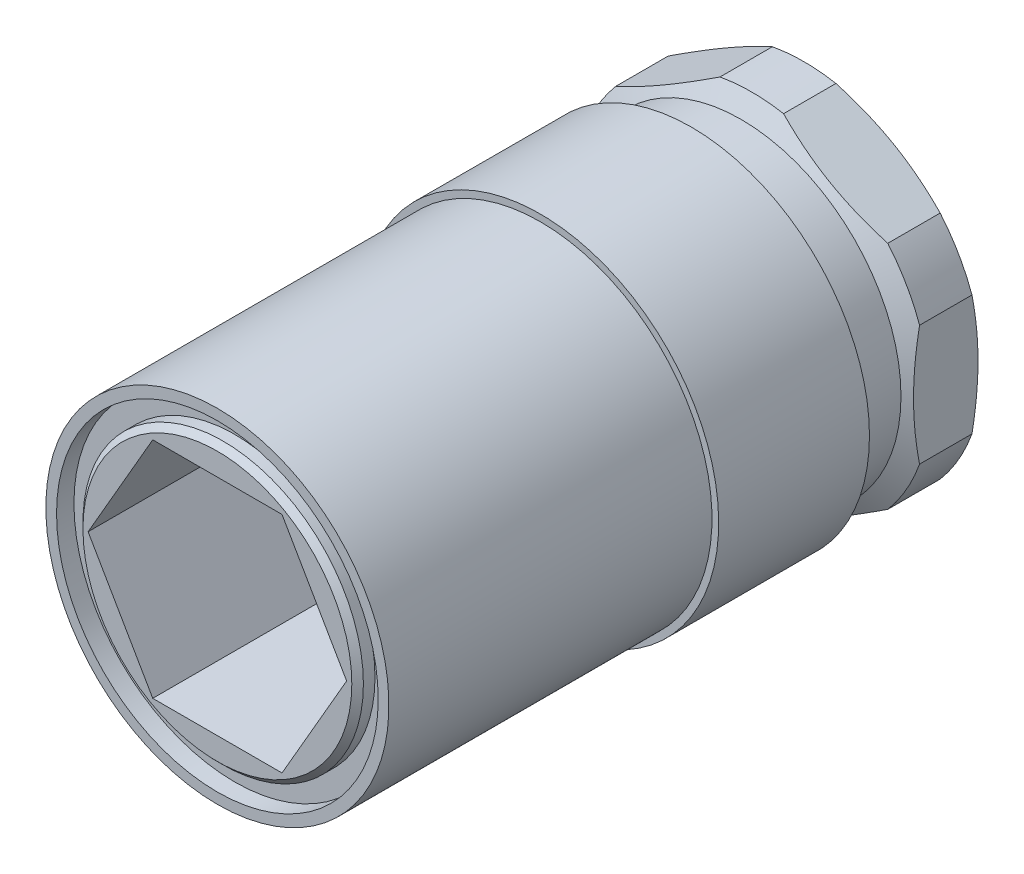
from build123d import *

# Parameters (mm, degrees)
SKETCH2_R           = 15.367
BOSS_EXTRUDE1_DEPTH = 51.5112
SKETCH5_OUTSIDE_W   = 46.214
SKETCH5_OUTSIDE_H   = 46.214
CUT_EXTRUDE1_DEPTH  = 6.35
SKETCH6_W           = 4.3053
SKETCH6_H           = 20
SKETCH11_R          = 13.867
SKETCH11_R_2        = 12.0904
CUT_EXTRUDE3_DEPTH  = 1.5
SKETCH23_R          = 10.668
CUT_EXTRUDE7_DEPTH  = 10
CUT_EXTRUDE7_DRAFT  = -3
SKETCH27_W          = 27.8559
SKETCH27_H          = 0.57785
CHAMFER5_SIZE       = 1
CHAMFER5_SIZE2      = 1.056754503
CHAMFER7_SIZE       = 0.5
CUT_EXTRUDE8_DEPTH  = 27.8559


with BuildPart() as part:
    # Sketch2 → Boss-Extrude1 (new body)
    with BuildSketch(Plane.XY):
        Circle(SKETCH2_R)
    extrude(amount=-BOSS_EXTRUDE1_DEPTH)

    # Sketch5 outside → Cut-Extrude1 (cut)
    with BuildSketch(Plane(origin=(0, 0, -51.5112), x_dir=(-1, 0, 0), z_dir=(0, 0, -1))):
        Rectangle(SKETCH5_OUTSIDE_W, SKETCH5_OUTSIDE_H)
        Polygon((-14.4653, -8.351544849), (0, -16.703089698), (14.4653, -8.351544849), (14.4653, 8.351544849), (0, 16.703089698), (-14.4653, 8.351544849), align=None, mode=Mode.SUBTRACT)
    extrude(amount=-CUT_EXTRUDE1_DEPTH, mode=Mode.SUBTRACT)

    # Sketch6 → Cut-Revolve1 (revolve, cut)
    with BuildSketch(Plane(origin=(0, 0, 0), x_dir=(0, 0, -1), z_dir=(1, 0, 0)), mode=Mode.PRIVATE) as cut_revolve1_sk:
        with Locations((43.00855, 23.7795)):
            Rectangle(SKETCH6_W, SKETCH6_H)
    revolve(cut_revolve1_sk.sketch.rotate(Axis((0, 0, 0), (0, 0, -1)), 90), axis=Axis((0, 0, 0), (0, 0, -1)), mode=Mode.SUBTRACT)

    # Sketch11 → Cut-Extrude3 (cut)
    with BuildSketch(Plane.XY):
        Circle(SKETCH11_R)
        Circle(SKETCH11_R_2, mode=Mode.SUBTRACT)
    extrude(amount=-CUT_EXTRUDE3_DEPTH, mode=Mode.SUBTRACT)

    # Sketch12 → Cut-Revolve2 (revolve, cut)
    with BuildSketch(Plane(origin=(0, 0, 0), x_dir=(0, 0, -1), z_dir=(1, 0, 0)), mode=Mode.PRIVATE) as cut_revolve2_sk:
        Polygon((45.1612, 17.660567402), (45.1612, 13.7795), (47.401935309, 17.660567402), align=None)
        Polygon((49.270464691, 17.660567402), (51.5112, 17.660567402), (51.5112, 13.7795), align=None)
    revolve(cut_revolve2_sk.sketch.rotate(Axis((0, 0, 0), (0, 0, -1)), 250.274825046), axis=Axis((0, 0, 0), (0, 0, -1)), mode=Mode.SUBTRACT)


with BuildPart() as cut_extrude7_tool:
    # Sketch23 → Cut-Extrude7 (with draft: the straight prism first)
    with BuildSketch(Plane(origin=(0, 0, -51.5112), x_dir=(-1, 0, 0), z_dir=(0, 0, -1))):
        Circle(SKETCH23_R)
    extrude(amount=-CUT_EXTRUDE7_DEPTH)
    # Cut-Extrude7: the draft: its side faces are tilted about the plane it starts from
    cut_extrude7_sides = [cut_extrude7_tool.faces().sort_by_distance(p)[0] for p in [
        (10.668, 0, -46.5112),
    ]]
    draft(cut_extrude7_sides, Plane(origin=(0, 0, -51.5112), x_dir=(-1, 0, 0), z_dir=(0, 0, -1)), CUT_EXTRUDE7_DRAFT)


with BuildPart() as part_1:
    add(part.part)

    # Cut-Extrude7: cut by cut_extrude7_tool
    add(cut_extrude7_tool.part, mode=Mode.SUBTRACT)

    # Sketch27 → Cut-Revolve5 (revolve, cut)
    with BuildSketch(Plane(origin=(0, 0, 0), x_dir=(0, 0, -1), z_dir=(1, 0, 0)), mode=Mode.PRIVATE) as cut_revolve5_sk:
        with Locations((13.92795, 15.078075)):
            Rectangle(SKETCH27_W, SKETCH27_H)
    revolve(cut_revolve5_sk.sketch.rotate(Axis((0, 0, 0), (0, 0, -1)), 180), axis=Axis((0, 0, 0), (0, 0, -1)), mode=Mode.SUBTRACT)

    # Chamfer5
    chamfer5_edges = [part_1.edges().sort_by_distance(p)[0] for p in [
        (10.668, 0, -51.5112),
    ]]
    chamfer5_side = [part_1.faces().sort_by_distance(p)[0] for p in [
        (12.60407727, 4.519162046, -51.5112),
    ]]
    chamfer(chamfer5_edges, length=CHAMFER5_SIZE, length2=CHAMFER5_SIZE2, reference=chamfer5_side[0])

    # Chamfer7
    chamfer7_edges = [part_1.edges().sort_by_distance(p)[0] for p in [
        (-12.0904, 0, 0),
    ]]
    chamfer(chamfer7_edges, length=CHAMFER7_SIZE)

    # Sketch29 → Cut-Revolve6 (revolve, cut)
    with BuildSketch(Plane(origin=(0, 0, 0), x_dir=(0, 0, -1), z_dir=(1, 0, 0)), mode=Mode.PRIVATE) as cut_revolve6_sk:
        Polygon((0, 0), (55.177374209, 0), (51.5112, 6.35), (27.8559, 6.35), (27.8559, 9.398), (0, 9.398), align=None)
    revolve(cut_revolve6_sk.sketch.rotate(Axis((0, 0, 3.947771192), (0, 0, -1)), 90), axis=Axis((0, 0, 3.947771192), (0, 0, -1)), mode=Mode.SUBTRACT)

    # Sketch30 → Cut-Extrude8 (cut)
    with BuildSketch(Plane.XY):
        Polygon((5.572584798, 9.652), (-5.572584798, 9.652), (-11.145169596, 0), (-5.572584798, -9.652), (5.572584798, -9.652), (11.145169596, 0), align=None)
    extrude(amount=-CUT_EXTRUDE8_DEPTH, mode=Mode.SUBTRACT)


solid = part_1.part
